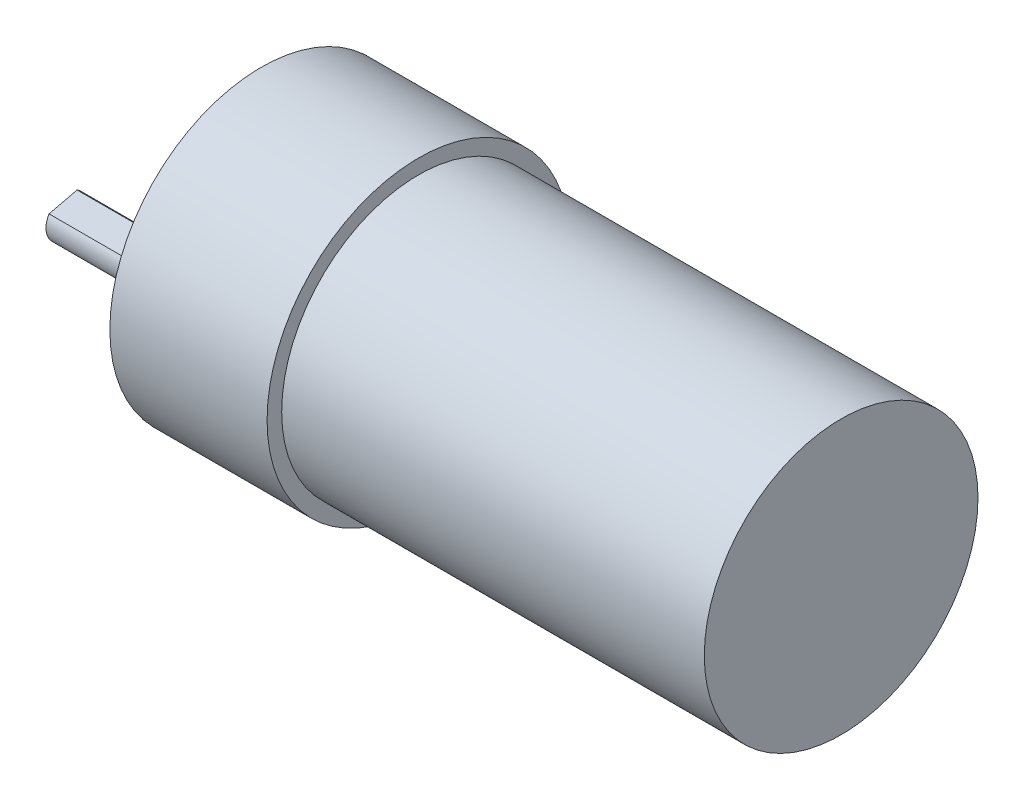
from build123d import *

# Parameters (mm, degrees)
SKETCH1_R          = 15.875
EXTRUDE1_DEPTH     = 49.022
SKETCH3_R          = 17.56918
EXTRUDE3_DEPTH     = 18.2372
SKETCH4_R          = 2.3749
EXTRUDE4_DEPTH     = 22.606
SKETCH5_R          = 1.27
CUT_EXTRUDE1_DEPTH = 10
SKETCH6_R          = 1.27
CUT_EXTRUDE2_DEPTH = 10
SKETCH7_W          = 17.727088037
SKETCH7_H          = 11.013879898
CUT_EXTRUDE3_DEPTH = 0.6858


with BuildPart() as part:
    # Sketch1 → Extrude1 (new body)
    with BuildSketch(Plane(origin=(0, 0, 0), x_dir=(0, 0, -1), z_dir=(1, 0, 0))):
        Circle(SKETCH1_R)
    extrude(amount=EXTRUDE1_DEPTH)

    # Sketch3 → Extrude3 (add)
    with BuildSketch(Plane.ZY):
        Circle(SKETCH3_R)
    extrude(amount=EXTRUDE3_DEPTH)

    # Sketch4 → Extrude4 (add)
    with BuildSketch(Plane.ZY.offset(18.2372)):
        with Locations(Location((0, -8.71855, 0), (0, 0, 180))):
            Circle(SKETCH4_R)
    extrude(amount=EXTRUDE4_DEPTH)

    # Sketch5 → Cut-Extrude1 (cut)
    with BuildSketch(Plane.ZY.offset(18.2372)):
        with Locations((0, 13.45565)):
            Circle(SKETCH5_R)
    extrude(amount=-CUT_EXTRUDE1_DEPTH, mode=Mode.SUBTRACT)

    # Sketch6 → Cut-Extrude2 (cut)
    with BuildSketch(Plane.ZY.offset(18.2372)):
        with Locations((10.2108, -8.71855)):
            Circle(SKETCH6_R)
        with Locations((-10.2108, -8.71855)):
            Circle(SKETCH6_R)
    extrude(amount=-CUT_EXTRUDE2_DEPTH, mode=Mode.SUBTRACT)

    # Sketch7 → Cut-Extrude3 (cut)
    with BuildSketch(Plane(origin=(0, -5.937135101, -1.41983909), x_dir=(-1, 0, 0), z_dir=(0, 0.9725755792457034, 0.2325870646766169))):
        with Locations((34.720744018, 1.438658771)):
            Rectangle(SKETCH7_W, SKETCH7_H)
    extrude(amount=-CUT_EXTRUDE3_DEPTH, mode=Mode.SUBTRACT)


solid = part.part
